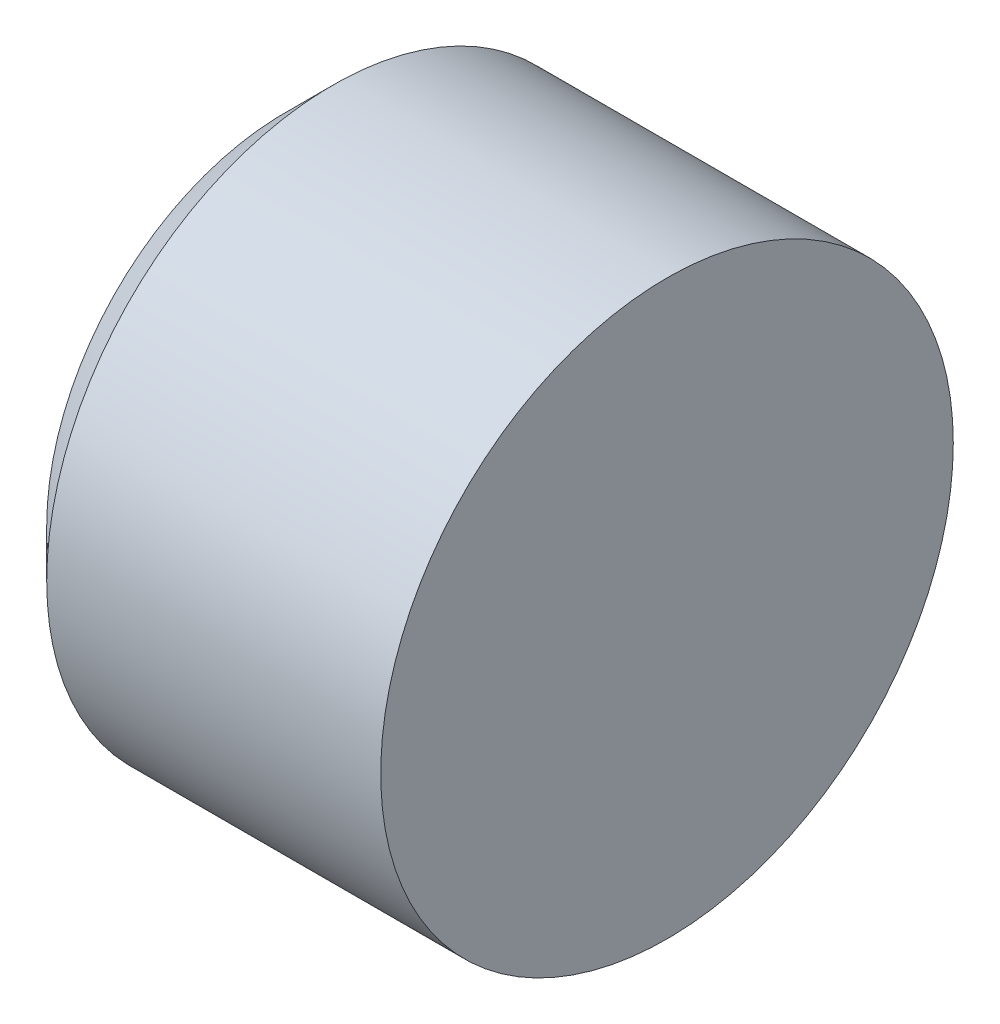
ISO-10303-21;
HEADER;
FILE_DESCRIPTION(('STEP AP214'),'2;1');
FILE_NAME('part.step','',(''),(''),'','','');
FILE_SCHEMA(('AUTOMOTIVE_DESIGN { 1 0 10303 214 1 1 1 1 }'));
ENDSEC;
DATA;
#1=APPLICATION_CONTEXT('core data for automotive mechanical design processes');
#2=APPLICATION_PROTOCOL_DEFINITION('international standard','automotive_design',2000,#1);
#3=PRODUCT_CONTEXT('',#1,'mechanical');
#4=PRODUCT('Part','Part','',(#3));
#5=PRODUCT_RELATED_PRODUCT_CATEGORY('part','',(#4));
#6=PRODUCT_DEFINITION_FORMATION('','',#4);
#7=PRODUCT_DEFINITION_CONTEXT('part definition',#1,'design');
#8=PRODUCT_DEFINITION('design','',#6,#7);
#9=PRODUCT_DEFINITION_SHAPE('','',#8);
#10=(LENGTH_UNIT() NAMED_UNIT(*) SI_UNIT(.MILLI.,.METRE.));
#11=(NAMED_UNIT(*) PLANE_ANGLE_UNIT() SI_UNIT($,.RADIAN.));
#12=(NAMED_UNIT(*) SI_UNIT($,.STERADIAN.) SOLID_ANGLE_UNIT());
#13=UNCERTAINTY_MEASURE_WITH_UNIT(LENGTH_MEASURE(1.E-05),#10,'distance_accuracy_value','');
#14=(GEOMETRIC_REPRESENTATION_CONTEXT(3) GLOBAL_UNCERTAINTY_ASSIGNED_CONTEXT((#13)) GLOBAL_UNIT_ASSIGNED_CONTEXT((#10,
#11,#12)) REPRESENTATION_CONTEXT('',''));
#15=CARTESIAN_POINT('',(0.,0.,0.));
#16=DIRECTION('',(0.,0.,1.));
#17=DIRECTION('',(1.,0.,0.));
#18=AXIS2_PLACEMENT_3D('',#15,#16,#17);
#19=CARTESIAN_POINT('',(8.69865731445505,-1.68891050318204,43.18));
#20=DIRECTION('',(1.,0.,0.));
#21=DIRECTION('',(0.,0.,-1.));
#22=AXIS2_PLACEMENT_3D('',#19,#20,#21);
#23=PLANE('',#22);
#24=CARTESIAN_POINT('',(8.69865731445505,0.,41.656));
#25=DIRECTION('',(1.,0.,0.));
#26=DIRECTION('',(0.,0.,-1.));
#27=AXIS2_PLACEMENT_3D('',#24,#25,#26);
#28=CIRCLE('',#27,1.524);
#29=CARTESIAN_POINT('',(8.69865731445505,0.,40.132));
#30=VERTEX_POINT('',#29);
#31=EDGE_CURVE('E31',#30,#30,#28,.F.);
#32=ORIENTED_EDGE('',*,*,#31,.F.);
#33=EDGE_LOOP('',(#32));
#34=FACE_BOUND('',#33,.T.);
#35=ADVANCED_FACE('F15',(#34),#23,.T.);
#36=CARTESIAN_POINT('',(6.66665731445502,-1.26999999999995,40.386));
#37=DIRECTION('',(-1.,0.,0.));
#38=DIRECTION('',(0.,0.,1.));
#39=AXIS2_PLACEMENT_3D('',#36,#37,#38);
#40=PLANE('',#39);
#41=CARTESIAN_POINT('',(6.66665731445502,0.,41.656));
#42=DIRECTION('',(-1.,0.,0.));
#43=DIRECTION('',(0.,0.,1.));
#44=AXIS2_PLACEMENT_3D('',#41,#42,#43);
#45=CIRCLE('',#44,1.27);
#46=CARTESIAN_POINT('',(6.66665731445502,0.,42.926));
#47=VERTEX_POINT('',#46);
#48=EDGE_CURVE('E19',#47,#47,#45,.F.);
#49=ORIENTED_EDGE('',*,*,#48,.F.);
#50=EDGE_LOOP('',(#49));
#51=FACE_BOUND('',#50,.T.);
#52=ADVANCED_FACE('F39',(#51),#40,.T.);
#53=CARTESIAN_POINT('',(6.92065731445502,0.,41.656));
#54=DIRECTION('',(1.,0.,0.));
#55=DIRECTION('',(0.,0.,-1.));
#56=AXIS2_PLACEMENT_3D('',#53,#54,#55);
#57=CYLINDRICAL_SURFACE('',#56,1.524);
#58=ORIENTED_EDGE('',*,*,#31,.T.);
#59=EDGE_LOOP('',(#58));
#60=FACE_BOUND('',#59,.T.);
#61=CARTESIAN_POINT('',(6.92065731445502,0.,41.656));
#62=DIRECTION('',(-1.,0.,0.));
#63=DIRECTION('',(0.,0.,1.));
#64=AXIS2_PLACEMENT_3D('',#61,#62,#63);
#65=CIRCLE('',#64,1.524);
#66=CARTESIAN_POINT('',(6.92065731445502,0.,43.18));
#67=VERTEX_POINT('',#66);
#68=EDGE_CURVE('E10',#67,#67,#65,.T.);
#69=ORIENTED_EDGE('',*,*,#68,.F.);
#70=EDGE_LOOP('',(#69));
#71=FACE_BOUND('',#70,.T.);
#72=ADVANCED_FACE('F35',(#60,#71),#57,.T.);
#73=CARTESIAN_POINT('',(6.92065731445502,0.,41.656));
#74=DIRECTION('',(1.,0.,0.));
#75=DIRECTION('',(0.,0.,-1.));
#76=AXIS2_PLACEMENT_3D('',#73,#74,#75);
#77=CONICAL_SURFACE('',#76,1.524,0.785398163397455);
#78=ORIENTED_EDGE('',*,*,#68,.T.);
#79=EDGE_LOOP('',(#78));
#80=FACE_BOUND('',#79,.T.);
#81=ORIENTED_EDGE('',*,*,#48,.T.);
#82=EDGE_LOOP('',(#81));
#83=FACE_BOUND('',#82,.T.);
#84=ADVANCED_FACE('F17',(#80,#83),#77,.T.);
#85=CLOSED_SHELL('',(#35,#52,#72,#84));
#86=MANIFOLD_SOLID_BREP('B1',#85);
#87=ADVANCED_BREP_SHAPE_REPRESENTATION('',(#18,#86),#14);
#88=SHAPE_DEFINITION_REPRESENTATION(#9,#87);
ENDSEC;
END-ISO-10303-21;
